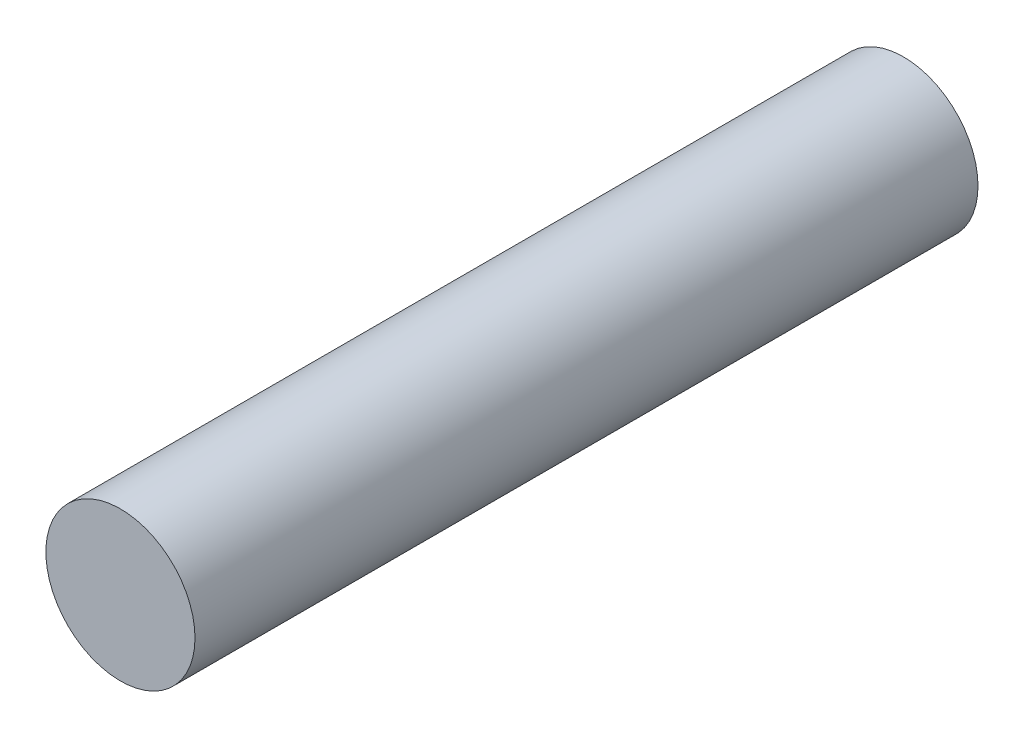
ISO-10303-21;
HEADER;
FILE_DESCRIPTION(('STEP AP214'),'2;1');
FILE_NAME('part.step','',(''),(''),'','','');
FILE_SCHEMA(('AUTOMOTIVE_DESIGN { 1 0 10303 214 1 1 1 1 }'));
ENDSEC;
DATA;
#1=APPLICATION_CONTEXT('core data for automotive mechanical design processes');
#2=APPLICATION_PROTOCOL_DEFINITION('international standard','automotive_design',2000,#1);
#3=PRODUCT_CONTEXT('',#1,'mechanical');
#4=PRODUCT('Part','Part','',(#3));
#5=PRODUCT_RELATED_PRODUCT_CATEGORY('part','',(#4));
#6=PRODUCT_DEFINITION_FORMATION('','',#4);
#7=PRODUCT_DEFINITION_CONTEXT('part definition',#1,'design');
#8=PRODUCT_DEFINITION('design','',#6,#7);
#9=PRODUCT_DEFINITION_SHAPE('','',#8);
#10=(LENGTH_UNIT() NAMED_UNIT(*) SI_UNIT(.MILLI.,.METRE.));
#11=(NAMED_UNIT(*) PLANE_ANGLE_UNIT() SI_UNIT($,.RADIAN.));
#12=(NAMED_UNIT(*) SI_UNIT($,.STERADIAN.) SOLID_ANGLE_UNIT());
#13=UNCERTAINTY_MEASURE_WITH_UNIT(LENGTH_MEASURE(1.E-05),#10,'distance_accuracy_value','');
#14=(GEOMETRIC_REPRESENTATION_CONTEXT(3) GLOBAL_UNCERTAINTY_ASSIGNED_CONTEXT((#13)) GLOBAL_UNIT_ASSIGNED_CONTEXT((#10,
#11,#12)) REPRESENTATION_CONTEXT('',''));
#15=CARTESIAN_POINT('',(0.,0.,0.));
#16=DIRECTION('',(0.,0.,1.));
#17=DIRECTION('',(1.,0.,0.));
#18=AXIS2_PLACEMENT_3D('',#15,#16,#17);
#19=CARTESIAN_POINT('',(0.,0.,42.));
#20=DIRECTION('',(0.,0.,1.));
#21=DIRECTION('',(1.,0.,0.));
#22=AXIS2_PLACEMENT_3D('',#19,#20,#21);
#23=PLANE('',#22);
#24=CARTESIAN_POINT('',(0.,0.,42.));
#25=DIRECTION('',(0.,0.,1.));
#26=DIRECTION('',(1.,0.,0.));
#27=AXIS2_PLACEMENT_3D('',#24,#25,#26);
#28=CIRCLE('',#27,4.);
#29=CARTESIAN_POINT('',(4.,0.,42.));
#30=VERTEX_POINT('',#29);
#31=EDGE_CURVE('E9',#30,#30,#28,.T.);
#32=ORIENTED_EDGE('',*,*,#31,.T.);
#33=EDGE_LOOP('',(#32));
#34=FACE_BOUND('',#33,.T.);
#35=ADVANCED_FACE('F14',(#34),#23,.T.);
#36=CARTESIAN_POINT('',(0.,0.,0.));
#37=DIRECTION('',(0.,0.,1.));
#38=DIRECTION('',(1.,0.,0.));
#39=AXIS2_PLACEMENT_3D('',#36,#37,#38);
#40=PLANE('',#39);
#41=CARTESIAN_POINT('',(0.,0.,0.));
#42=DIRECTION('',(0.,0.,1.));
#43=DIRECTION('',(1.,0.,0.));
#44=AXIS2_PLACEMENT_3D('',#41,#42,#43);
#45=CIRCLE('',#44,4.);
#46=CARTESIAN_POINT('',(4.,0.,0.));
#47=VERTEX_POINT('',#46);
#48=EDGE_CURVE('E17',#47,#47,#45,.T.);
#49=ORIENTED_EDGE('',*,*,#48,.F.);
#50=EDGE_LOOP('',(#49));
#51=FACE_BOUND('',#50,.T.);
#52=ADVANCED_FACE('F35',(#51),#40,.F.);
#53=CARTESIAN_POINT('',(0.,0.,0.));
#54=DIRECTION('',(0.,0.,-1.));
#55=DIRECTION('',(1.,0.,0.));
#56=AXIS2_PLACEMENT_3D('',#53,#54,#55);
#57=CYLINDRICAL_SURFACE('',#56,4.);
#58=ORIENTED_EDGE('',*,*,#31,.F.);
#59=EDGE_LOOP('',(#58));
#60=FACE_BOUND('',#59,.T.);
#61=ORIENTED_EDGE('',*,*,#48,.T.);
#62=EDGE_LOOP('',(#61));
#63=FACE_BOUND('',#62,.T.);
#64=ADVANCED_FACE('F32',(#60,#63),#57,.T.);
#65=CLOSED_SHELL('',(#35,#52,#64));
#66=MANIFOLD_SOLID_BREP('B1',#65);
#67=ADVANCED_BREP_SHAPE_REPRESENTATION('',(#18,#66),#14);
#68=SHAPE_DEFINITION_REPRESENTATION(#9,#67);
ENDSEC;
END-ISO-10303-21;
